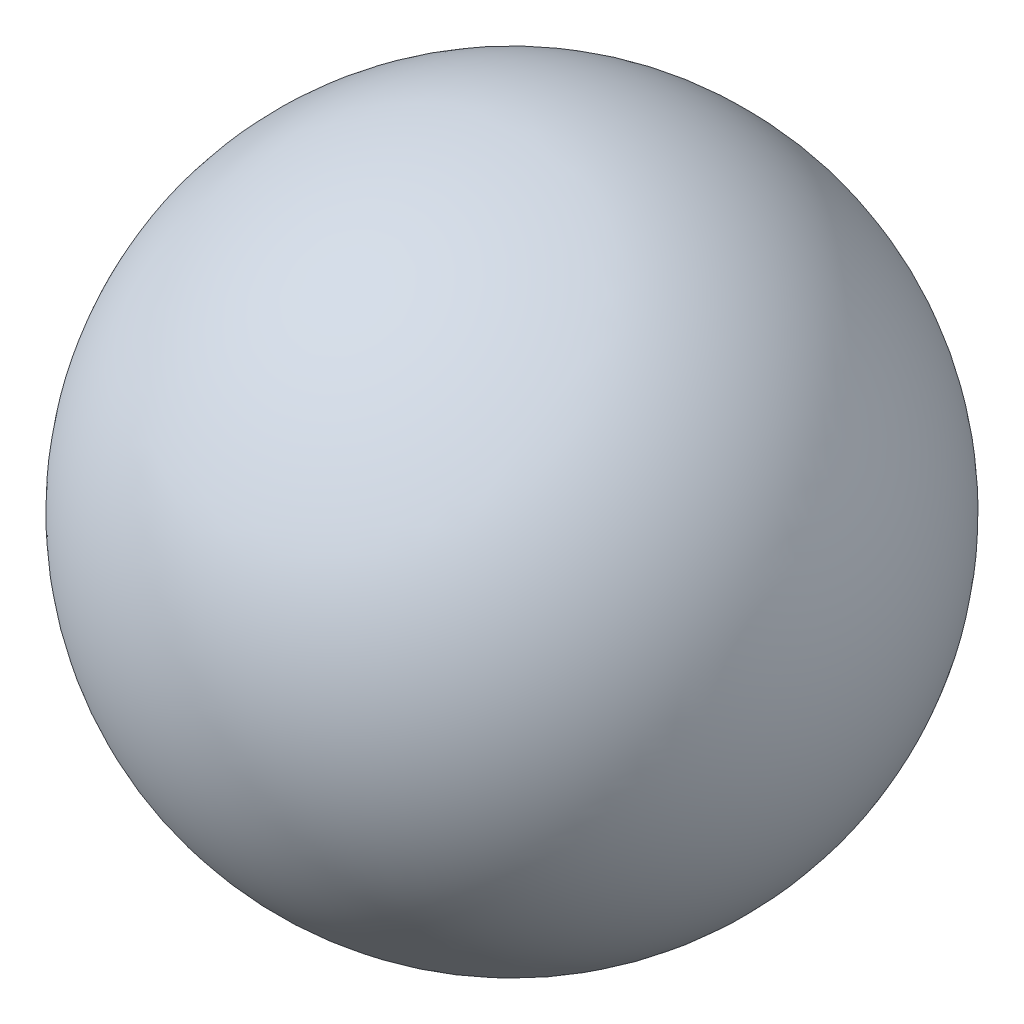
from build123d import *


with BuildPart() as part:
    # Esquisse1 → R_volution1 (revolve)
    with BuildSketch(Plane.XY):
        with BuildLine():
            Line((-1, 0), (1, 0))
            ThreePointArc((1, 0), (0, 1), (-1, 0))
        make_face()
    revolve(axis=Axis((-12.269491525, 0, 0), (1, 0, 0)))


solid = part.part
